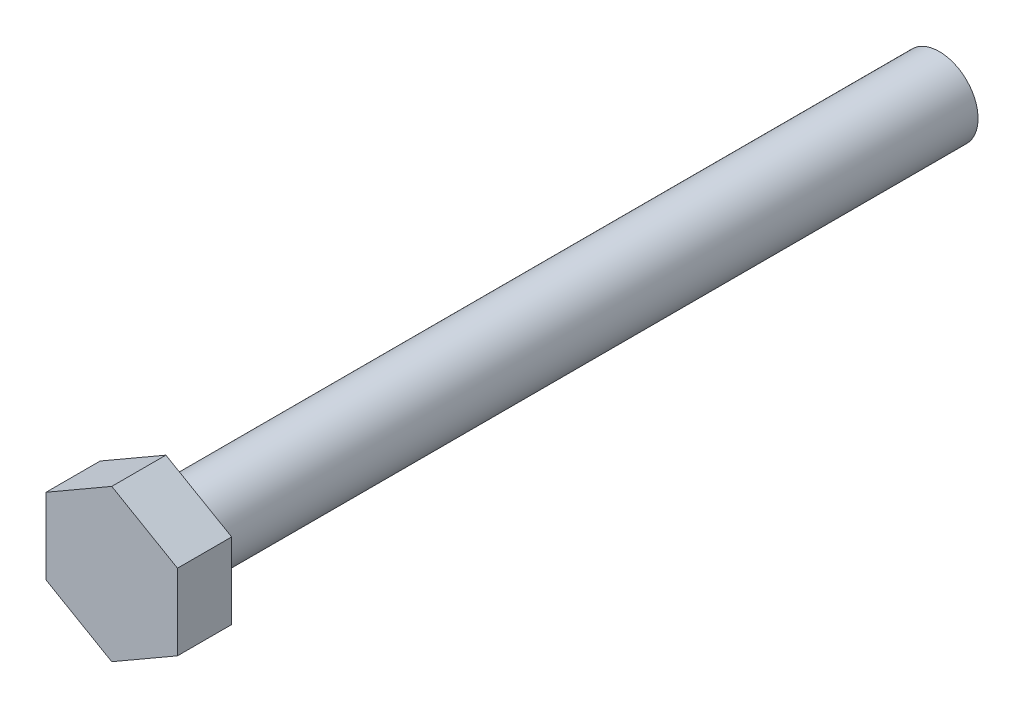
ISO-10303-21;
HEADER;
FILE_DESCRIPTION(('STEP AP214'),'2;1');
FILE_NAME('part.step','',(''),(''),'','','');
FILE_SCHEMA(('AUTOMOTIVE_DESIGN { 1 0 10303 214 1 1 1 1 }'));
ENDSEC;
DATA;
#1=APPLICATION_CONTEXT('core data for automotive mechanical design processes');
#2=APPLICATION_PROTOCOL_DEFINITION('international standard','automotive_design',2000,#1);
#3=PRODUCT_CONTEXT('',#1,'mechanical');
#4=PRODUCT('Part','Part','',(#3));
#5=PRODUCT_RELATED_PRODUCT_CATEGORY('part','',(#4));
#6=PRODUCT_DEFINITION_FORMATION('','',#4);
#7=PRODUCT_DEFINITION_CONTEXT('part definition',#1,'design');
#8=PRODUCT_DEFINITION('design','',#6,#7);
#9=PRODUCT_DEFINITION_SHAPE('','',#8);
#10=(LENGTH_UNIT() NAMED_UNIT(*) SI_UNIT(.MILLI.,.METRE.));
#11=(NAMED_UNIT(*) PLANE_ANGLE_UNIT() SI_UNIT($,.RADIAN.));
#12=(NAMED_UNIT(*) SI_UNIT($,.STERADIAN.) SOLID_ANGLE_UNIT());
#13=UNCERTAINTY_MEASURE_WITH_UNIT(LENGTH_MEASURE(1.E-05),#10,'distance_accuracy_value','');
#14=(GEOMETRIC_REPRESENTATION_CONTEXT(3) GLOBAL_UNCERTAINTY_ASSIGNED_CONTEXT((#13)) GLOBAL_UNIT_ASSIGNED_CONTEXT((#10,
#11,#12)) REPRESENTATION_CONTEXT('',''));
#15=CARTESIAN_POINT('',(0.,0.,0.));
#16=DIRECTION('',(0.,0.,1.));
#17=DIRECTION('',(1.,0.,0.));
#18=AXIS2_PLACEMENT_3D('',#15,#16,#17);
#19=CARTESIAN_POINT('',(0.,9.81495457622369,0.));
#20=DIRECTION('',(0.,0.,1.));
#21=DIRECTION('',(1.,0.,0.));
#22=AXIS2_PLACEMENT_3D('',#19,#20,#21);
#23=PLANE('',#22);
#24=DIRECTION('',(0.866025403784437,0.5,0.));
#25=VECTOR('',#24,1.);
#26=CARTESIAN_POINT('',(-8.5,4.90747728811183,0.));
#27=LINE('',#26,#25);
#28=CARTESIAN_POINT('',(-8.5,4.90747728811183,0.));
#29=VERTEX_POINT('',#28);
#30=CARTESIAN_POINT('',(0.,9.81495457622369,0.));
#31=VERTEX_POINT('',#30);
#32=EDGE_CURVE('E69',#29,#31,#27,.T.);
#33=ORIENTED_EDGE('',*,*,#32,.T.);
#34=DIRECTION('',(-0.866025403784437,0.5,0.));
#35=VECTOR('',#34,1.);
#36=CARTESIAN_POINT('',(8.5,4.90747728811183,0.));
#37=LINE('',#36,#35);
#38=CARTESIAN_POINT('',(8.5,4.90747728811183,0.));
#39=VERTEX_POINT('',#38);
#40=EDGE_CURVE('E83',#39,#31,#37,.T.);
#41=ORIENTED_EDGE('',*,*,#40,.F.);
#42=DIRECTION('',(0.,-1.,0.));
#43=VECTOR('',#42,1.);
#44=CARTESIAN_POINT('',(8.5,4.90747728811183,0.));
#45=LINE('',#44,#43);
#46=CARTESIAN_POINT('',(8.5,-4.90747728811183,0.));
#47=VERTEX_POINT('',#46);
#48=EDGE_CURVE('E90',#39,#47,#45,.T.);
#49=ORIENTED_EDGE('',*,*,#48,.T.);
#50=DIRECTION('',(-0.866025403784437,-0.5,0.));
#51=VECTOR('',#50,1.);
#52=CARTESIAN_POINT('',(8.5,-4.90747728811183,0.));
#53=LINE('',#52,#51);
#54=CARTESIAN_POINT('',(0.,-9.81495457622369,0.));
#55=VERTEX_POINT('',#54);
#56=EDGE_CURVE('E92',#47,#55,#53,.T.);
#57=ORIENTED_EDGE('',*,*,#56,.T.);
#58=DIRECTION('',(0.866025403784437,-0.5,0.));
#59=VECTOR('',#58,1.);
#60=CARTESIAN_POINT('',(-8.5,-4.90747728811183,0.));
#61=LINE('',#60,#59);
#62=CARTESIAN_POINT('',(-8.5,-4.90747728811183,0.));
#63=VERTEX_POINT('',#62);
#64=EDGE_CURVE('E98',#63,#55,#61,.T.);
#65=ORIENTED_EDGE('',*,*,#64,.F.);
#66=DIRECTION('',(0.,-1.,0.));
#67=VECTOR('',#66,1.);
#68=CARTESIAN_POINT('',(-8.5,4.90747728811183,0.));
#69=LINE('',#68,#67);
#70=EDGE_CURVE('E86',#29,#63,#69,.T.);
#71=ORIENTED_EDGE('',*,*,#70,.F.);
#72=EDGE_LOOP('',(#33,#41,#49,#57,#65,#71));
#73=FACE_BOUND('',#72,.T.);
#74=CARTESIAN_POINT('',(0.,0.,0.));
#75=DIRECTION('',(0.,0.,-1.));
#76=DIRECTION('',(-1.,0.,0.));
#77=AXIS2_PLACEMENT_3D('',#74,#75,#76);
#78=CIRCLE('',#77,5.);
#79=CARTESIAN_POINT('',(-5.,0.,0.));
#80=VERTEX_POINT('',#79);
#81=EDGE_CURVE('E9',#80,#80,#78,.T.);
#82=ORIENTED_EDGE('',*,*,#81,.F.);
#83=EDGE_LOOP('',(#82));
#84=FACE_BOUND('',#83,.T.);
#85=ADVANCED_FACE('F14',(#73,#84),#23,.F.);
#86=CARTESIAN_POINT('',(-8.5,4.90747728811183,7.));
#87=DIRECTION('',(-0.5,0.866025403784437,0.));
#88=DIRECTION('',(-0.866025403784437,-0.5,0.));
#89=AXIS2_PLACEMENT_3D('',#86,#87,#88);
#90=PLANE('',#89);
#91=DIRECTION('',(0.,0.,-1.));
#92=VECTOR('',#91,1.);
#93=CARTESIAN_POINT('',(-8.5,4.90747728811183,7.));
#94=LINE('',#93,#92);
#95=CARTESIAN_POINT('',(-8.5,4.90747728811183,7.));
#96=VERTEX_POINT('',#95);
#97=EDGE_CURVE('E18',#96,#29,#94,.T.);
#98=ORIENTED_EDGE('',*,*,#97,.F.);
#99=DIRECTION('',(0.866025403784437,0.5,0.));
#100=VECTOR('',#99,1.);
#101=CARTESIAN_POINT('',(-8.5,4.90747728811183,7.));
#102=LINE('',#101,#100);
#103=CARTESIAN_POINT('',(0.,9.81495457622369,7.));
#104=VERTEX_POINT('',#103);
#105=EDGE_CURVE('E71',#96,#104,#102,.T.);
#106=ORIENTED_EDGE('',*,*,#105,.T.);
#107=DIRECTION('',(0.,0.,-1.));
#108=VECTOR('',#107,1.);
#109=CARTESIAN_POINT('',(0.,9.81495457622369,7.));
#110=LINE('',#109,#108);
#111=EDGE_CURVE('E66',#104,#31,#110,.T.);
#112=ORIENTED_EDGE('',*,*,#111,.T.);
#113=ORIENTED_EDGE('',*,*,#32,.F.);
#114=EDGE_LOOP('',(#98,#106,#112,#113));
#115=FACE_BOUND('',#114,.T.);
#116=ADVANCED_FACE('F68',(#115),#90,.T.);
#117=CARTESIAN_POINT('',(-8.5,4.90747728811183,7.));
#118=DIRECTION('',(1.,0.,0.));
#119=DIRECTION('',(0.,0.,-1.));
#120=AXIS2_PLACEMENT_3D('',#117,#118,#119);
#121=PLANE('',#120);
#122=DIRECTION('',(0.,0.,-1.));
#123=VECTOR('',#122,1.);
#124=CARTESIAN_POINT('',(-8.5,-4.90747728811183,7.));
#125=LINE('',#124,#123);
#126=CARTESIAN_POINT('',(-8.5,-4.90747728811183,7.));
#127=VERTEX_POINT('',#126);
#128=EDGE_CURVE('E37',#127,#63,#125,.T.);
#129=ORIENTED_EDGE('',*,*,#128,.F.);
#130=DIRECTION('',(0.,-1.,0.));
#131=VECTOR('',#130,1.);
#132=CARTESIAN_POINT('',(-8.5,4.90747728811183,7.));
#133=LINE('',#132,#131);
#134=EDGE_CURVE('E77',#96,#127,#133,.T.);
#135=ORIENTED_EDGE('',*,*,#134,.F.);
#136=ORIENTED_EDGE('',*,*,#97,.T.);
#137=ORIENTED_EDGE('',*,*,#70,.T.);
#138=EDGE_LOOP('',(#129,#135,#136,#137));
#139=FACE_BOUND('',#138,.T.);
#140=ADVANCED_FACE('F16',(#139),#121,.F.);
#141=CARTESIAN_POINT('',(-8.5,-4.90747728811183,7.));
#142=DIRECTION('',(0.5,0.866025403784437,0.));
#143=DIRECTION('',(-0.866025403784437,0.5,0.));
#144=AXIS2_PLACEMENT_3D('',#141,#142,#143);
#145=PLANE('',#144);
#146=DIRECTION('',(0.,0.,-1.));
#147=VECTOR('',#146,1.);
#148=CARTESIAN_POINT('',(0.,-9.81495457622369,7.));
#149=LINE('',#148,#147);
#150=CARTESIAN_POINT('',(0.,-9.81495457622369,7.));
#151=VERTEX_POINT('',#150);
#152=EDGE_CURVE('E119',#151,#55,#149,.T.);
#153=ORIENTED_EDGE('',*,*,#152,.F.);
#154=DIRECTION('',(0.866025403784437,-0.5,0.));
#155=VECTOR('',#154,1.);
#156=CARTESIAN_POINT('',(-8.5,-4.90747728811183,7.));
#157=LINE('',#156,#155);
#158=EDGE_CURVE('E111',#127,#151,#157,.T.);
#159=ORIENTED_EDGE('',*,*,#158,.F.);
#160=ORIENTED_EDGE('',*,*,#128,.T.);
#161=ORIENTED_EDGE('',*,*,#64,.T.);
#162=EDGE_LOOP('',(#153,#159,#160,#161));
#163=FACE_BOUND('',#162,.T.);
#164=ADVANCED_FACE('F130',(#163),#145,.F.);
#165=CARTESIAN_POINT('',(8.5,-4.90747728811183,7.));
#166=DIRECTION('',(0.5,-0.866025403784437,0.));
#167=DIRECTION('',(0.866025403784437,0.5,0.));
#168=AXIS2_PLACEMENT_3D('',#165,#166,#167);
#169=PLANE('',#168);
#170=DIRECTION('',(0.,0.,-1.));
#171=VECTOR('',#170,1.);
#172=CARTESIAN_POINT('',(8.5,-4.90747728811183,7.));
#173=LINE('',#172,#171);
#174=CARTESIAN_POINT('',(8.5,-4.90747728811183,7.));
#175=VERTEX_POINT('',#174);
#176=EDGE_CURVE('E117',#175,#47,#173,.T.);
#177=ORIENTED_EDGE('',*,*,#176,.F.);
#178=DIRECTION('',(-0.866025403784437,-0.5,0.));
#179=VECTOR('',#178,1.);
#180=CARTESIAN_POINT('',(8.5,-4.90747728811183,7.));
#181=LINE('',#180,#179);
#182=EDGE_CURVE('E108',#175,#151,#181,.T.);
#183=ORIENTED_EDGE('',*,*,#182,.T.);
#184=ORIENTED_EDGE('',*,*,#152,.T.);
#185=ORIENTED_EDGE('',*,*,#56,.F.);
#186=EDGE_LOOP('',(#177,#183,#184,#185));
#187=FACE_BOUND('',#186,.T.);
#188=ADVANCED_FACE('F129',(#187),#169,.T.);
#189=CARTESIAN_POINT('',(8.5,4.90747728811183,7.));
#190=DIRECTION('',(1.,0.,0.));
#191=DIRECTION('',(0.,0.,-1.));
#192=AXIS2_PLACEMENT_3D('',#189,#190,#191);
#193=PLANE('',#192);
#194=DIRECTION('',(0.,0.,-1.));
#195=VECTOR('',#194,1.);
#196=CARTESIAN_POINT('',(8.5,4.90747728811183,7.));
#197=LINE('',#196,#195);
#198=CARTESIAN_POINT('',(8.5,4.90747728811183,7.));
#199=VERTEX_POINT('',#198);
#200=EDGE_CURVE('E76',#199,#39,#197,.T.);
#201=ORIENTED_EDGE('',*,*,#200,.F.);
#202=DIRECTION('',(0.,-1.,0.));
#203=VECTOR('',#202,1.);
#204=CARTESIAN_POINT('',(8.5,4.90747728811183,7.));
#205=LINE('',#204,#203);
#206=EDGE_CURVE('E105',#199,#175,#205,.T.);
#207=ORIENTED_EDGE('',*,*,#206,.T.);
#208=ORIENTED_EDGE('',*,*,#176,.T.);
#209=ORIENTED_EDGE('',*,*,#48,.F.);
#210=EDGE_LOOP('',(#201,#207,#208,#209));
#211=FACE_BOUND('',#210,.T.);
#212=ADVANCED_FACE('F126',(#211),#193,.T.);
#213=CARTESIAN_POINT('',(8.5,4.90747728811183,7.));
#214=DIRECTION('',(-0.5,-0.866025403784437,0.));
#215=DIRECTION('',(0.866025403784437,-0.5,0.));
#216=AXIS2_PLACEMENT_3D('',#213,#214,#215);
#217=PLANE('',#216);
#218=DIRECTION('',(-0.866025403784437,0.5,0.));
#219=VECTOR('',#218,1.);
#220=CARTESIAN_POINT('',(8.5,4.90747728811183,7.));
#221=LINE('',#220,#219);
#222=EDGE_CURVE('E103',#199,#104,#221,.T.);
#223=ORIENTED_EDGE('',*,*,#222,.F.);
#224=ORIENTED_EDGE('',*,*,#200,.T.);
#225=ORIENTED_EDGE('',*,*,#40,.T.);
#226=ORIENTED_EDGE('',*,*,#111,.F.);
#227=EDGE_LOOP('',(#223,#224,#225,#226));
#228=FACE_BOUND('',#227,.T.);
#229=ADVANCED_FACE('F89',(#228),#217,.F.);
#230=CARTESIAN_POINT('',(0.,9.81495457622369,7.));
#231=DIRECTION('',(0.,0.,1.));
#232=DIRECTION('',(1.,0.,0.));
#233=AXIS2_PLACEMENT_3D('',#230,#231,#232);
#234=PLANE('',#233);
#235=ORIENTED_EDGE('',*,*,#105,.F.);
#236=ORIENTED_EDGE('',*,*,#134,.T.);
#237=ORIENTED_EDGE('',*,*,#158,.T.);
#238=ORIENTED_EDGE('',*,*,#182,.F.);
#239=ORIENTED_EDGE('',*,*,#206,.F.);
#240=ORIENTED_EDGE('',*,*,#222,.T.);
#241=EDGE_LOOP('',(#235,#236,#237,#238,#239,#240));
#242=FACE_BOUND('',#241,.T.);
#243=ADVANCED_FACE('F122',(#242),#234,.T.);
#244=CARTESIAN_POINT('',(0.,0.,-100.));
#245=DIRECTION('',(0.,0.,1.));
#246=DIRECTION('',(1.,0.,0.));
#247=AXIS2_PLACEMENT_3D('',#244,#245,#246);
#248=CYLINDRICAL_SURFACE('',#247,5.);
#249=CARTESIAN_POINT('',(0.,0.,-100.));
#250=DIRECTION('',(0.,0.,-1.));
#251=DIRECTION('',(-1.,0.,0.));
#252=AXIS2_PLACEMENT_3D('',#249,#250,#251);
#253=CIRCLE('',#252,5.);
#254=CARTESIAN_POINT('',(-5.,0.,-100.));
#255=VERTEX_POINT('',#254);
#256=EDGE_CURVE('E87',#255,#255,#253,.T.);
#257=ORIENTED_EDGE('',*,*,#256,.F.);
#258=EDGE_LOOP('',(#257));
#259=FACE_BOUND('',#258,.T.);
#260=ORIENTED_EDGE('',*,*,#81,.T.);
#261=EDGE_LOOP('',(#260));
#262=FACE_BOUND('',#261,.T.);
#263=ADVANCED_FACE('F148',(#259,#262),#248,.T.);
#264=CARTESIAN_POINT('',(0.,0.,-100.));
#265=DIRECTION('',(0.,0.,-1.));
#266=DIRECTION('',(-1.,0.,0.));
#267=AXIS2_PLACEMENT_3D('',#264,#265,#266);
#268=PLANE('',#267);
#269=ORIENTED_EDGE('',*,*,#256,.T.);
#270=EDGE_LOOP('',(#269));
#271=FACE_BOUND('',#270,.T.);
#272=ADVANCED_FACE('F154',(#271),#268,.T.);
#273=CLOSED_SHELL('',(#85,#116,#140,#164,#188,#212,#229,#243,#263,#272));
#274=MANIFOLD_SOLID_BREP('B1',#273);
#275=ADVANCED_BREP_SHAPE_REPRESENTATION('',(#18,#274),#14);
#276=SHAPE_DEFINITION_REPRESENTATION(#9,#275);
ENDSEC;
END-ISO-10303-21;
